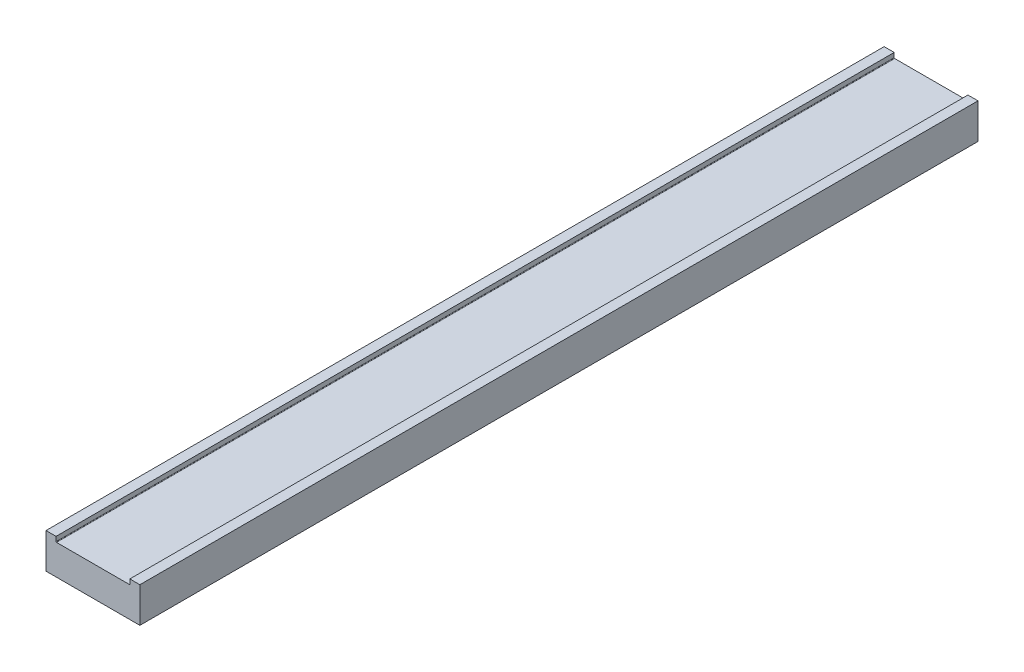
ISO-10303-21;
HEADER;
FILE_DESCRIPTION(('STEP AP214'),'2;1');
FILE_NAME('part.step','',(''),(''),'','','');
FILE_SCHEMA(('AUTOMOTIVE_DESIGN { 1 0 10303 214 1 1 1 1 }'));
ENDSEC;
DATA;
#1=APPLICATION_CONTEXT('core data for automotive mechanical design processes');
#2=APPLICATION_PROTOCOL_DEFINITION('international standard','automotive_design',2000,#1);
#3=PRODUCT_CONTEXT('',#1,'mechanical');
#4=PRODUCT('Part','Part','',(#3));
#5=PRODUCT_RELATED_PRODUCT_CATEGORY('part','',(#4));
#6=PRODUCT_DEFINITION_FORMATION('','',#4);
#7=PRODUCT_DEFINITION_CONTEXT('part definition',#1,'design');
#8=PRODUCT_DEFINITION('design','',#6,#7);
#9=PRODUCT_DEFINITION_SHAPE('','',#8);
#10=(LENGTH_UNIT() NAMED_UNIT(*) SI_UNIT(.MILLI.,.METRE.));
#11=(NAMED_UNIT(*) PLANE_ANGLE_UNIT() SI_UNIT($,.RADIAN.));
#12=(NAMED_UNIT(*) SI_UNIT($,.STERADIAN.) SOLID_ANGLE_UNIT());
#13=UNCERTAINTY_MEASURE_WITH_UNIT(LENGTH_MEASURE(1.E-05),#10,'distance_accuracy_value','');
#14=(GEOMETRIC_REPRESENTATION_CONTEXT(3) GLOBAL_UNCERTAINTY_ASSIGNED_CONTEXT((#13)) GLOBAL_UNIT_ASSIGNED_CONTEXT((#10,
#11,#12)) REPRESENTATION_CONTEXT('',''));
#15=CARTESIAN_POINT('',(0.,0.,0.));
#16=DIRECTION('',(0.,0.,1.));
#17=DIRECTION('',(1.,0.,0.));
#18=AXIS2_PLACEMENT_3D('',#15,#16,#17);
#19=CARTESIAN_POINT('',(-28.,21.,0.));
#20=DIRECTION('',(-1.,0.,0.));
#21=DIRECTION('',(0.,0.,1.));
#22=AXIS2_PLACEMENT_3D('',#19,#20,#21);
#23=PLANE('',#22);
#24=DIRECTION('',(0.,-1.,0.));
#25=VECTOR('',#24,1.);
#26=CARTESIAN_POINT('',(-28.,21.,500.));
#27=LINE('',#26,#25);
#28=CARTESIAN_POINT('',(-28.,21.,500.));
#29=VERTEX_POINT('',#28);
#30=CARTESIAN_POINT('',(-28.,0.,500.));
#31=VERTEX_POINT('',#30);
#32=EDGE_CURVE('E124',#29,#31,#27,.T.);
#33=ORIENTED_EDGE('',*,*,#32,.F.);
#34=DIRECTION('',(0.,0.,1.));
#35=VECTOR('',#34,1.);
#36=CARTESIAN_POINT('',(-28.,21.,0.));
#37=LINE('',#36,#35);
#38=CARTESIAN_POINT('',(-28.,21.,0.));
#39=VERTEX_POINT('',#38);
#40=EDGE_CURVE('E9',#39,#29,#37,.T.);
#41=ORIENTED_EDGE('',*,*,#40,.F.);
#42=DIRECTION('',(0.,-1.,0.));
#43=VECTOR('',#42,1.);
#44=CARTESIAN_POINT('',(-28.,21.,0.));
#45=LINE('',#44,#43);
#46=CARTESIAN_POINT('',(-28.,0.,0.));
#47=VERTEX_POINT('',#46);
#48=EDGE_CURVE('E146',#39,#47,#45,.T.);
#49=ORIENTED_EDGE('',*,*,#48,.T.);
#50=DIRECTION('',(0.,0.,1.));
#51=VECTOR('',#50,1.);
#52=CARTESIAN_POINT('',(-28.,0.,0.));
#53=LINE('',#52,#51);
#54=EDGE_CURVE('E17',#47,#31,#53,.T.);
#55=ORIENTED_EDGE('',*,*,#54,.T.);
#56=EDGE_LOOP('',(#33,#41,#49,#55));
#57=FACE_BOUND('',#56,.T.);
#58=ADVANCED_FACE('F14',(#57),#23,.T.);
#59=CARTESIAN_POINT('',(-28.,21.,0.));
#60=DIRECTION('',(0.,-1.,0.));
#61=DIRECTION('',(0.,0.,-1.));
#62=AXIS2_PLACEMENT_3D('',#59,#60,#61);
#63=PLANE('',#62);
#64=DIRECTION('',(1.,0.,0.));
#65=VECTOR('',#64,1.);
#66=CARTESIAN_POINT('',(-28.,21.,500.));
#67=LINE('',#66,#65);
#68=CARTESIAN_POINT('',(-22.,21.,500.));
#69=VERTEX_POINT('',#68);
#70=EDGE_CURVE('E65',#29,#69,#67,.T.);
#71=ORIENTED_EDGE('',*,*,#70,.T.);
#72=DIRECTION('',(0.,0.,1.));
#73=VECTOR('',#72,1.);
#74=CARTESIAN_POINT('',(-22.,21.,0.));
#75=LINE('',#74,#73);
#76=CARTESIAN_POINT('',(-22.,21.,0.));
#77=VERTEX_POINT('',#76);
#78=EDGE_CURVE('E23',#77,#69,#75,.T.);
#79=ORIENTED_EDGE('',*,*,#78,.F.);
#80=DIRECTION('',(1.,0.,0.));
#81=VECTOR('',#80,1.);
#82=CARTESIAN_POINT('',(-28.,21.,0.));
#83=LINE('',#82,#81);
#84=EDGE_CURVE('E102',#39,#77,#83,.T.);
#85=ORIENTED_EDGE('',*,*,#84,.F.);
#86=ORIENTED_EDGE('',*,*,#40,.T.);
#87=EDGE_LOOP('',(#71,#79,#85,#86));
#88=FACE_BOUND('',#87,.T.);
#89=ADVANCED_FACE('F207',(#88),#63,.F.);
#90=CARTESIAN_POINT('',(-22.,21.,0.));
#91=DIRECTION('',(-1.,0.,0.));
#92=DIRECTION('',(0.,0.,1.));
#93=AXIS2_PLACEMENT_3D('',#90,#91,#92);
#94=PLANE('',#93);
#95=DIRECTION('',(0.,-1.,0.));
#96=VECTOR('',#95,1.);
#97=CARTESIAN_POINT('',(-22.,21.,500.));
#98=LINE('',#97,#96);
#99=CARTESIAN_POINT('',(-22.,18.3,500.));
#100=VERTEX_POINT('',#99);
#101=EDGE_CURVE('E109',#69,#100,#98,.T.);
#102=ORIENTED_EDGE('',*,*,#101,.T.);
#103=DIRECTION('',(0.,0.,1.));
#104=VECTOR('',#103,1.);
#105=CARTESIAN_POINT('',(-22.,18.3,0.));
#106=LINE('',#105,#104);
#107=CARTESIAN_POINT('',(-22.,18.3,0.));
#108=VERTEX_POINT('',#107);
#109=EDGE_CURVE('E106',#108,#100,#106,.T.);
#110=ORIENTED_EDGE('',*,*,#109,.F.);
#111=DIRECTION('',(0.,-1.,0.));
#112=VECTOR('',#111,1.);
#113=CARTESIAN_POINT('',(-22.,21.,0.));
#114=LINE('',#113,#112);
#115=EDGE_CURVE('E95',#77,#108,#114,.T.);
#116=ORIENTED_EDGE('',*,*,#115,.F.);
#117=ORIENTED_EDGE('',*,*,#78,.T.);
#118=EDGE_LOOP('',(#102,#110,#116,#117));
#119=FACE_BOUND('',#118,.T.);
#120=ADVANCED_FACE('F107',(#119),#94,.F.);
#121=CARTESIAN_POINT('',(-21.7,18.3,0.));
#122=DIRECTION('',(0.,0.,1.));
#123=DIRECTION('',(1.,0.,0.));
#124=AXIS2_PLACEMENT_3D('',#121,#122,#123);
#125=CYLINDRICAL_SURFACE('',#124,0.299999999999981);
#126=CARTESIAN_POINT('',(-21.7,18.3,500.));
#127=DIRECTION('',(0.,0.,1.));
#128=DIRECTION('',(1.,0.,0.));
#129=AXIS2_PLACEMENT_3D('',#126,#127,#128);
#130=CIRCLE('',#129,0.299999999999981);
#131=CARTESIAN_POINT('',(-21.7,18.,500.));
#132=VERTEX_POINT('',#131);
#133=EDGE_CURVE('E143',#100,#132,#130,.T.);
#134=ORIENTED_EDGE('',*,*,#133,.T.);
#135=DIRECTION('',(0.,0.,1.));
#136=VECTOR('',#135,1.);
#137=CARTESIAN_POINT('',(-21.7,18.,0.));
#138=LINE('',#137,#136);
#139=CARTESIAN_POINT('',(-21.7,18.,0.));
#140=VERTEX_POINT('',#139);
#141=EDGE_CURVE('E112',#140,#132,#138,.T.);
#142=ORIENTED_EDGE('',*,*,#141,.F.);
#143=CARTESIAN_POINT('',(-21.7,18.3,0.));
#144=DIRECTION('',(0.,0.,1.));
#145=DIRECTION('',(1.,0.,0.));
#146=AXIS2_PLACEMENT_3D('',#143,#144,#145);
#147=CIRCLE('',#146,0.299999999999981);
#148=EDGE_CURVE('E100',#108,#140,#147,.T.);
#149=ORIENTED_EDGE('',*,*,#148,.F.);
#150=ORIENTED_EDGE('',*,*,#109,.T.);
#151=EDGE_LOOP('',(#134,#142,#149,#150));
#152=FACE_BOUND('',#151,.T.);
#153=ADVANCED_FACE('F114',(#152),#125,.F.);
#154=CARTESIAN_POINT('',(-21.7,18.,0.));
#155=DIRECTION('',(0.,-1.,0.));
#156=DIRECTION('',(1.,0.,0.));
#157=AXIS2_PLACEMENT_3D('',#154,#155,#156);
#158=PLANE('',#157);
#159=DIRECTION('',(1.,0.,0.));
#160=VECTOR('',#159,1.);
#161=CARTESIAN_POINT('',(-21.7,18.,500.));
#162=LINE('',#161,#160);
#163=CARTESIAN_POINT('',(21.7,18.,500.));
#164=VERTEX_POINT('',#163);
#165=EDGE_CURVE('E141',#132,#164,#162,.T.);
#166=ORIENTED_EDGE('',*,*,#165,.T.);
#167=DIRECTION('',(0.,0.,1.));
#168=VECTOR('',#167,1.);
#169=CARTESIAN_POINT('',(21.7,18.,0.));
#170=LINE('',#169,#168);
#171=CARTESIAN_POINT('',(21.7,18.,0.));
#172=VERTEX_POINT('',#171);
#173=EDGE_CURVE('E150',#172,#164,#170,.T.);
#174=ORIENTED_EDGE('',*,*,#173,.F.);
#175=DIRECTION('',(1.,0.,0.));
#176=VECTOR('',#175,1.);
#177=CARTESIAN_POINT('',(-21.7,18.,0.));
#178=LINE('',#177,#176);
#179=EDGE_CURVE('E117',#140,#172,#178,.T.);
#180=ORIENTED_EDGE('',*,*,#179,.F.);
#181=ORIENTED_EDGE('',*,*,#141,.T.);
#182=EDGE_LOOP('',(#166,#174,#180,#181));
#183=FACE_BOUND('',#182,.T.);
#184=ADVANCED_FACE('F168',(#183),#158,.F.);
#185=CARTESIAN_POINT('',(21.7,18.3,0.));
#186=DIRECTION('',(0.,0.,1.));
#187=DIRECTION('',(1.,0.,0.));
#188=AXIS2_PLACEMENT_3D('',#185,#186,#187);
#189=CYLINDRICAL_SURFACE('',#188,0.299999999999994);
#190=CARTESIAN_POINT('',(21.7,18.3,500.));
#191=DIRECTION('',(0.,0.,1.));
#192=DIRECTION('',(1.,0.,0.));
#193=AXIS2_PLACEMENT_3D('',#190,#191,#192);
#194=CIRCLE('',#193,0.299999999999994);
#195=CARTESIAN_POINT('',(22.,18.3,500.));
#196=VERTEX_POINT('',#195);
#197=EDGE_CURVE('E138',#164,#196,#194,.T.);
#198=ORIENTED_EDGE('',*,*,#197,.T.);
#199=DIRECTION('',(0.,0.,1.));
#200=VECTOR('',#199,1.);
#201=CARTESIAN_POINT('',(22.,18.3,0.));
#202=LINE('',#201,#200);
#203=CARTESIAN_POINT('',(22.,18.3,0.));
#204=VERTEX_POINT('',#203);
#205=EDGE_CURVE('E153',#204,#196,#202,.T.);
#206=ORIENTED_EDGE('',*,*,#205,.F.);
#207=CARTESIAN_POINT('',(21.7,18.3,0.));
#208=DIRECTION('',(0.,0.,1.));
#209=DIRECTION('',(1.,0.,0.));
#210=AXIS2_PLACEMENT_3D('',#207,#208,#209);
#211=CIRCLE('',#210,0.299999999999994);
#212=EDGE_CURVE('E119',#172,#204,#211,.T.);
#213=ORIENTED_EDGE('',*,*,#212,.F.);
#214=ORIENTED_EDGE('',*,*,#173,.T.);
#215=EDGE_LOOP('',(#198,#206,#213,#214));
#216=FACE_BOUND('',#215,.T.);
#217=ADVANCED_FACE('F176',(#216),#189,.F.);
#218=CARTESIAN_POINT('',(22.,21.,0.));
#219=DIRECTION('',(-1.,0.,0.));
#220=DIRECTION('',(0.,0.,1.));
#221=AXIS2_PLACEMENT_3D('',#218,#219,#220);
#222=PLANE('',#221);
#223=DIRECTION('',(0.,-1.,0.));
#224=VECTOR('',#223,1.);
#225=CARTESIAN_POINT('',(22.,21.,500.));
#226=LINE('',#225,#224);
#227=CARTESIAN_POINT('',(22.,21.,500.));
#228=VERTEX_POINT('',#227);
#229=EDGE_CURVE('E135',#228,#196,#226,.T.);
#230=ORIENTED_EDGE('',*,*,#229,.F.);
#231=DIRECTION('',(0.,0.,1.));
#232=VECTOR('',#231,1.);
#233=CARTESIAN_POINT('',(22.,21.,0.));
#234=LINE('',#233,#232);
#235=CARTESIAN_POINT('',(22.,21.,0.));
#236=VERTEX_POINT('',#235);
#237=EDGE_CURVE('E155',#236,#228,#234,.T.);
#238=ORIENTED_EDGE('',*,*,#237,.F.);
#239=DIRECTION('',(0.,-1.,0.));
#240=VECTOR('',#239,1.);
#241=CARTESIAN_POINT('',(22.,21.,0.));
#242=LINE('',#241,#240);
#243=EDGE_CURVE('E174',#236,#204,#242,.T.);
#244=ORIENTED_EDGE('',*,*,#243,.T.);
#245=ORIENTED_EDGE('',*,*,#205,.T.);
#246=EDGE_LOOP('',(#230,#238,#244,#245));
#247=FACE_BOUND('',#246,.T.);
#248=ADVANCED_FACE('F179',(#247),#222,.T.);
#249=CARTESIAN_POINT('',(22.,21.,0.));
#250=DIRECTION('',(0.,-1.,0.));
#251=DIRECTION('',(0.,0.,-1.));
#252=AXIS2_PLACEMENT_3D('',#249,#250,#251);
#253=PLANE('',#252);
#254=DIRECTION('',(1.,0.,0.));
#255=VECTOR('',#254,1.);
#256=CARTESIAN_POINT('',(22.,21.,500.));
#257=LINE('',#256,#255);
#258=CARTESIAN_POINT('',(28.,21.,500.));
#259=VERTEX_POINT('',#258);
#260=EDGE_CURVE('E133',#228,#259,#257,.T.);
#261=ORIENTED_EDGE('',*,*,#260,.T.);
#262=DIRECTION('',(0.,0.,1.));
#263=VECTOR('',#262,1.);
#264=CARTESIAN_POINT('',(28.,21.,0.));
#265=LINE('',#264,#263);
#266=CARTESIAN_POINT('',(28.,21.,0.));
#267=VERTEX_POINT('',#266);
#268=EDGE_CURVE('E157',#267,#259,#265,.T.);
#269=ORIENTED_EDGE('',*,*,#268,.F.);
#270=DIRECTION('',(1.,0.,0.));
#271=VECTOR('',#270,1.);
#272=CARTESIAN_POINT('',(22.,21.,0.));
#273=LINE('',#272,#271);
#274=EDGE_CURVE('E181',#236,#267,#273,.T.);
#275=ORIENTED_EDGE('',*,*,#274,.F.);
#276=ORIENTED_EDGE('',*,*,#237,.T.);
#277=EDGE_LOOP('',(#261,#269,#275,#276));
#278=FACE_BOUND('',#277,.T.);
#279=ADVANCED_FACE('F195',(#278),#253,.F.);
#280=CARTESIAN_POINT('',(28.,21.,0.));
#281=DIRECTION('',(-1.,0.,0.));
#282=DIRECTION('',(0.,0.,1.));
#283=AXIS2_PLACEMENT_3D('',#280,#281,#282);
#284=PLANE('',#283);
#285=DIRECTION('',(0.,-1.,0.));
#286=VECTOR('',#285,1.);
#287=CARTESIAN_POINT('',(28.,21.,500.));
#288=LINE('',#287,#286);
#289=CARTESIAN_POINT('',(28.,0.,500.));
#290=VERTEX_POINT('',#289);
#291=EDGE_CURVE('E130',#259,#290,#288,.T.);
#292=ORIENTED_EDGE('',*,*,#291,.T.);
#293=DIRECTION('',(0.,0.,1.));
#294=VECTOR('',#293,1.);
#295=CARTESIAN_POINT('',(28.,0.,0.));
#296=LINE('',#295,#294);
#297=CARTESIAN_POINT('',(28.,0.,0.));
#298=VERTEX_POINT('',#297);
#299=EDGE_CURVE('E159',#298,#290,#296,.T.);
#300=ORIENTED_EDGE('',*,*,#299,.F.);
#301=DIRECTION('',(0.,-1.,0.));
#302=VECTOR('',#301,1.);
#303=CARTESIAN_POINT('',(28.,21.,0.));
#304=LINE('',#303,#302);
#305=EDGE_CURVE('E183',#267,#298,#304,.T.);
#306=ORIENTED_EDGE('',*,*,#305,.F.);
#307=ORIENTED_EDGE('',*,*,#268,.T.);
#308=EDGE_LOOP('',(#292,#300,#306,#307));
#309=FACE_BOUND('',#308,.T.);
#310=ADVANCED_FACE('F192',(#309),#284,.F.);
#311=CARTESIAN_POINT('',(-28.,0.,0.));
#312=DIRECTION('',(0.,-1.,0.));
#313=DIRECTION('',(0.,0.,-1.));
#314=AXIS2_PLACEMENT_3D('',#311,#312,#313);
#315=PLANE('',#314);
#316=DIRECTION('',(1.,0.,0.));
#317=VECTOR('',#316,1.);
#318=CARTESIAN_POINT('',(-28.,0.,500.));
#319=LINE('',#318,#317);
#320=EDGE_CURVE('E127',#31,#290,#319,.T.);
#321=ORIENTED_EDGE('',*,*,#320,.F.);
#322=ORIENTED_EDGE('',*,*,#54,.F.);
#323=DIRECTION('',(1.,0.,0.));
#324=VECTOR('',#323,1.);
#325=CARTESIAN_POINT('',(-28.,0.,0.));
#326=LINE('',#325,#324);
#327=EDGE_CURVE('E187',#47,#298,#326,.T.);
#328=ORIENTED_EDGE('',*,*,#327,.T.);
#329=ORIENTED_EDGE('',*,*,#299,.T.);
#330=EDGE_LOOP('',(#321,#322,#328,#329));
#331=FACE_BOUND('',#330,.T.);
#332=ADVANCED_FACE('F161',(#331),#315,.T.);
#333=CARTESIAN_POINT('',(21.7,18.3,0.));
#334=DIRECTION('',(0.,0.,1.));
#335=DIRECTION('',(1.,0.,0.));
#336=AXIS2_PLACEMENT_3D('',#333,#334,#335);
#337=PLANE('',#336);
#338=ORIENTED_EDGE('',*,*,#48,.F.);
#339=ORIENTED_EDGE('',*,*,#84,.T.);
#340=ORIENTED_EDGE('',*,*,#115,.T.);
#341=ORIENTED_EDGE('',*,*,#148,.T.);
#342=ORIENTED_EDGE('',*,*,#179,.T.);
#343=ORIENTED_EDGE('',*,*,#212,.T.);
#344=ORIENTED_EDGE('',*,*,#243,.F.);
#345=ORIENTED_EDGE('',*,*,#274,.T.);
#346=ORIENTED_EDGE('',*,*,#305,.T.);
#347=ORIENTED_EDGE('',*,*,#327,.F.);
#348=EDGE_LOOP('',(#338,#339,#340,#341,#342,#343,#344,#345,#346,#347));
#349=FACE_BOUND('',#348,.T.);
#350=ADVANCED_FACE('F98',(#349),#337,.F.);
#351=CARTESIAN_POINT('',(21.7,18.3,500.));
#352=DIRECTION('',(0.,0.,1.));
#353=DIRECTION('',(1.,0.,0.));
#354=AXIS2_PLACEMENT_3D('',#351,#352,#353);
#355=PLANE('',#354);
#356=ORIENTED_EDGE('',*,*,#32,.T.);
#357=ORIENTED_EDGE('',*,*,#320,.T.);
#358=ORIENTED_EDGE('',*,*,#291,.F.);
#359=ORIENTED_EDGE('',*,*,#260,.F.);
#360=ORIENTED_EDGE('',*,*,#229,.T.);
#361=ORIENTED_EDGE('',*,*,#197,.F.);
#362=ORIENTED_EDGE('',*,*,#165,.F.);
#363=ORIENTED_EDGE('',*,*,#133,.F.);
#364=ORIENTED_EDGE('',*,*,#101,.F.);
#365=ORIENTED_EDGE('',*,*,#70,.F.);
#366=EDGE_LOOP('',(#356,#357,#358,#359,#360,#361,#362,#363,#364,#365));
#367=FACE_BOUND('',#366,.T.);
#368=ADVANCED_FACE('F164',(#367),#355,.T.);
#369=CLOSED_SHELL('',(#58,#89,#120,#153,#184,#217,#248,#279,#310,#332,#350,#368));
#370=MANIFOLD_SOLID_BREP('B1',#369);
#371=ADVANCED_BREP_SHAPE_REPRESENTATION('',(#18,#370),#14);
#372=SHAPE_DEFINITION_REPRESENTATION(#9,#371);
ENDSEC;
END-ISO-10303-21;
